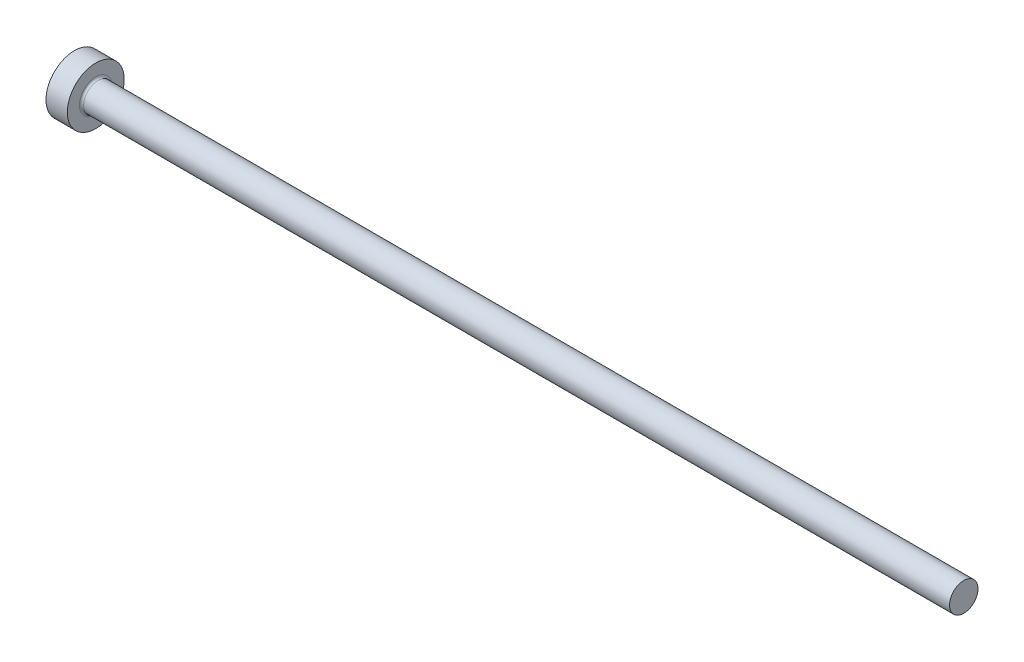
ISO-10303-21;
HEADER;
FILE_DESCRIPTION(('STEP AP214'),'2;1');
FILE_NAME('part.step','',(''),(''),'','','');
FILE_SCHEMA(('AUTOMOTIVE_DESIGN { 1 0 10303 214 1 1 1 1 }'));
ENDSEC;
DATA;
#1=APPLICATION_CONTEXT('core data for automotive mechanical design processes');
#2=APPLICATION_PROTOCOL_DEFINITION('international standard','automotive_design',2000,#1);
#3=PRODUCT_CONTEXT('',#1,'mechanical');
#4=PRODUCT('Part','Part','',(#3));
#5=PRODUCT_RELATED_PRODUCT_CATEGORY('part','',(#4));
#6=PRODUCT_DEFINITION_FORMATION('','',#4);
#7=PRODUCT_DEFINITION_CONTEXT('part definition',#1,'design');
#8=PRODUCT_DEFINITION('design','',#6,#7);
#9=PRODUCT_DEFINITION_SHAPE('','',#8);
#10=(LENGTH_UNIT() NAMED_UNIT(*) SI_UNIT(.MILLI.,.METRE.));
#11=(NAMED_UNIT(*) PLANE_ANGLE_UNIT() SI_UNIT($,.RADIAN.));
#12=(NAMED_UNIT(*) SI_UNIT($,.STERADIAN.) SOLID_ANGLE_UNIT());
#13=UNCERTAINTY_MEASURE_WITH_UNIT(LENGTH_MEASURE(1.E-05),#10,'distance_accuracy_value','');
#14=(GEOMETRIC_REPRESENTATION_CONTEXT(3) GLOBAL_UNCERTAINTY_ASSIGNED_CONTEXT((#13)) GLOBAL_UNIT_ASSIGNED_CONTEXT((#10,
#11,#12)) REPRESENTATION_CONTEXT('',''));
#15=CARTESIAN_POINT('',(0.,0.,0.));
#16=DIRECTION('',(0.,0.,1.));
#17=DIRECTION('',(1.,0.,0.));
#18=AXIS2_PLACEMENT_3D('',#15,#16,#17);
#19=CARTESIAN_POINT('',(0.,0.,0.));
#20=DIRECTION('',(-1.,0.,0.));
#21=DIRECTION('',(0.,-1.,0.));
#22=AXIS2_PLACEMENT_3D('',#19,#20,#21);
#23=PLANE('',#22);
#24=CARTESIAN_POINT('',(0.,0.,0.));
#25=DIRECTION('',(1.,0.,0.));
#26=DIRECTION('',(0.,1.,0.));
#27=AXIS2_PLACEMENT_3D('',#24,#25,#26);
#28=CIRCLE('',#27,4.);
#29=CARTESIAN_POINT('',(0.,4.,0.));
#30=VERTEX_POINT('',#29);
#31=EDGE_CURVE('E25',#30,#30,#28,.T.);
#32=ORIENTED_EDGE('',*,*,#31,.F.);
#33=EDGE_LOOP('',(#32));
#34=FACE_BOUND('',#33,.T.);
#35=ADVANCED_FACE('F14',(#34),#23,.T.);
#36=CARTESIAN_POINT('',(125.,0.,0.));
#37=DIRECTION('',(1.,0.,0.));
#38=DIRECTION('',(0.,1.,0.));
#39=AXIS2_PLACEMENT_3D('',#36,#37,#38);
#40=CYLINDRICAL_SURFACE('',#39,4.);
#41=ORIENTED_EDGE('',*,*,#31,.T.);
#42=EDGE_LOOP('',(#41));
#43=FACE_BOUND('',#42,.T.);
#44=CARTESIAN_POINT('',(3.,0.,0.));
#45=DIRECTION('',(1.,0.,0.));
#46=DIRECTION('',(0.,1.,0.));
#47=AXIS2_PLACEMENT_3D('',#44,#45,#46);
#48=CIRCLE('',#47,4.);
#49=CARTESIAN_POINT('',(3.,4.,0.));
#50=VERTEX_POINT('',#49);
#51=EDGE_CURVE('E29',#50,#50,#48,.T.);
#52=ORIENTED_EDGE('',*,*,#51,.F.);
#53=EDGE_LOOP('',(#52));
#54=FACE_BOUND('',#53,.T.);
#55=ADVANCED_FACE('F51',(#43,#54),#40,.T.);
#56=CARTESIAN_POINT('',(3.,4.,0.));
#57=DIRECTION('',(1.,0.,0.));
#58=DIRECTION('',(0.,1.,0.));
#59=AXIS2_PLACEMENT_3D('',#56,#57,#58);
#60=PLANE('',#59);
#61=CARTESIAN_POINT('',(3.,0.,0.));
#62=DIRECTION('',(1.,0.,0.));
#63=DIRECTION('',(0.,1.,0.));
#64=AXIS2_PLACEMENT_3D('',#61,#62,#63);
#65=CIRCLE('',#64,2.29999999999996);
#66=CARTESIAN_POINT('',(3.,2.29999999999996,0.));
#67=VERTEX_POINT('',#66);
#68=EDGE_CURVE('E9',#67,#67,#65,.F.);
#69=ORIENTED_EDGE('',*,*,#68,.T.);
#70=EDGE_LOOP('',(#69));
#71=FACE_BOUND('',#70,.T.);
#72=ORIENTED_EDGE('',*,*,#51,.T.);
#73=EDGE_LOOP('',(#72));
#74=FACE_BOUND('',#73,.T.);
#75=ADVANCED_FACE('F42',(#71,#74),#60,.T.);
#76=CARTESIAN_POINT('',(125.,0.,0.));
#77=DIRECTION('',(1.,0.,0.));
#78=DIRECTION('',(0.,1.,0.));
#79=AXIS2_PLACEMENT_3D('',#76,#77,#78);
#80=CYLINDRICAL_SURFACE('',#79,1.99999999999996);
#81=CARTESIAN_POINT('',(3.3,0.,0.));
#82=DIRECTION('',(1.,0.,0.));
#83=DIRECTION('',(0.,1.,0.));
#84=AXIS2_PLACEMENT_3D('',#81,#82,#83);
#85=CIRCLE('',#84,1.99999999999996);
#86=CARTESIAN_POINT('',(3.3,1.99999999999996,0.));
#87=VERTEX_POINT('',#86);
#88=EDGE_CURVE('E21',#87,#87,#85,.T.);
#89=ORIENTED_EDGE('',*,*,#88,.T.);
#90=EDGE_LOOP('',(#89));
#91=FACE_BOUND('',#90,.T.);
#92=CARTESIAN_POINT('',(125.,0.,0.));
#93=DIRECTION('',(1.,0.,0.));
#94=DIRECTION('',(0.,1.,0.));
#95=AXIS2_PLACEMENT_3D('',#92,#93,#94);
#96=CIRCLE('',#95,2.);
#97=CARTESIAN_POINT('',(125.,2.,0.));
#98=VERTEX_POINT('',#97);
#99=EDGE_CURVE('E34',#98,#98,#96,.T.);
#100=ORIENTED_EDGE('',*,*,#99,.F.);
#101=EDGE_LOOP('',(#100));
#102=FACE_BOUND('',#101,.T.);
#103=ADVANCED_FACE('F40',(#91,#102),#80,.T.);
#104=CARTESIAN_POINT('',(125.,2.,0.));
#105=DIRECTION('',(1.,0.,0.));
#106=DIRECTION('',(0.,1.,0.));
#107=AXIS2_PLACEMENT_3D('',#104,#105,#106);
#108=PLANE('',#107);
#109=ORIENTED_EDGE('',*,*,#99,.T.);
#110=EDGE_LOOP('',(#109));
#111=FACE_BOUND('',#110,.T.);
#112=ADVANCED_FACE('F38',(#111),#108,.T.);
#113=CARTESIAN_POINT('',(3.3,0.,0.));
#114=DIRECTION('',(1.,0.,0.));
#115=DIRECTION('',(0.,1.,0.));
#116=AXIS2_PLACEMENT_3D('',#113,#114,#115);
#117=TOROIDAL_SURFACE('',#116,2.29999999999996,0.3);
#118=ORIENTED_EDGE('',*,*,#68,.F.);
#119=EDGE_LOOP('',(#118));
#120=FACE_BOUND('',#119,.T.);
#121=ORIENTED_EDGE('',*,*,#88,.F.);
#122=EDGE_LOOP('',(#121));
#123=FACE_BOUND('',#122,.T.);
#124=ADVANCED_FACE('F16',(#120,#123),#117,.F.);
#125=CLOSED_SHELL('',(#35,#55,#75,#103,#112,#124));
#126=MANIFOLD_SOLID_BREP('B1',#125);
#127=ADVANCED_BREP_SHAPE_REPRESENTATION('',(#18,#126),#14);
#128=SHAPE_DEFINITION_REPRESENTATION(#9,#127);
ENDSEC;
END-ISO-10303-21;
